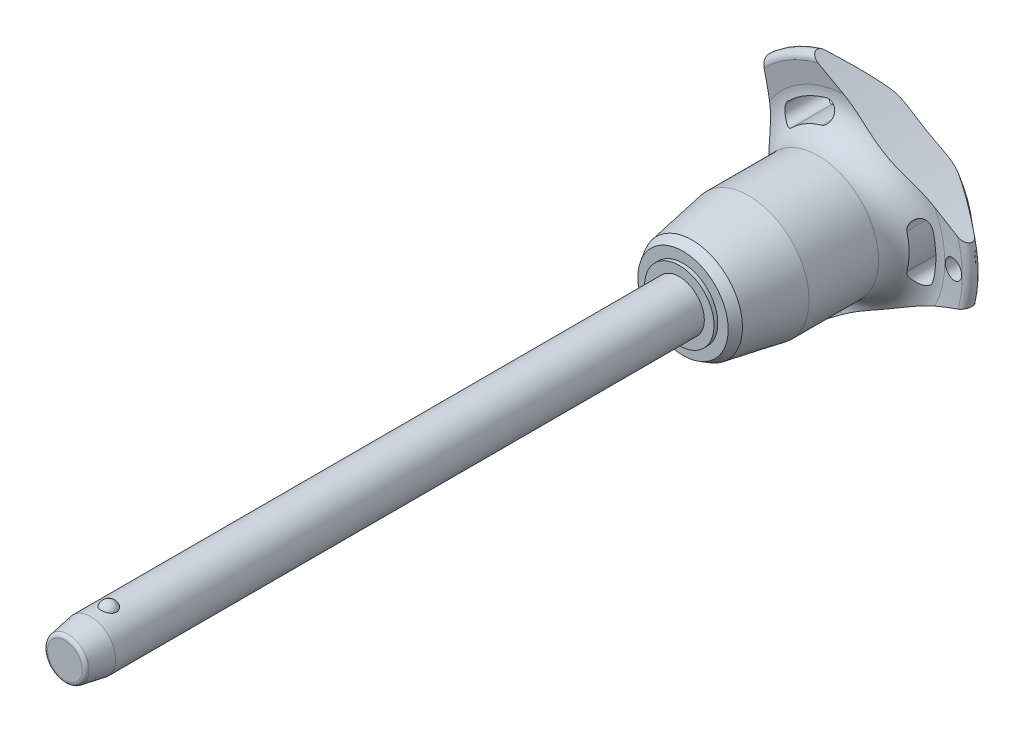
from build123d import *

# Parameters (mm, degrees)
SKETCH1_R           = 4
BOSS_EXTRUDE1_DEPTH = 90
SKETCH2_R           = 3.4
BOSS_EXTRUDE2_DEPTH = 33.3
BOSS_EXTRUDE3_START = 8.2
SKETCH1_2_R         = 4
BOSS_EXTRUDE3_DEPTH = 8.2
CHAMFER1_SIZE       = 4.1
CHAMFER1_SIZE2      = 0.722940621
FILLET1_R           = 0.6
SKETCH6_R           = 102.8
CUT_EXTRUDE1_DEPTH  = 127.380768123
CIRPATTERN1_COUNT   = 3
SKETCH7_R           = 1.5
CUT_EXTRUDE2_DEPTH  = 127.252726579


with BuildPart() as part:
    # Sketch1 → Boss-Extrude1 (new body)
    with BuildSketch(Plane.XY):
        Circle(SKETCH1_R)
    extrude(amount=-BOSS_EXTRUDE1_DEPTH)

    # Sketch2 → Boss-Extrude2 (add)
    with BuildSketch(Plane(origin=(0, 0, -90), x_dir=(-1, 0, 0), z_dir=(0, 0, -1))):
        Circle(SKETCH2_R)
    extrude(amount=BOSS_EXTRUDE2_DEPTH)

    # Sketch3 → Revolve1 (revolve)
    with BuildSketch(Plane(origin=(0, 0, 0), x_dir=(0, 0, -1), z_dir=(1, 0, 0))):
        with BuildLine():
            Line((-1.2, 4.8), (-1.2, 2.2))
            ThreePointArc((-1.2, 2.2), (0.1, 3.5), (-1.2, 4.8))
        make_face()
        with BuildLine():
            Line((-1.2, -2.2), (-1.2, -4.8))
            ThreePointArc((-1.2, -4.8), (0.1, -3.5), (-1.2, -2.2))
        make_face()
    revolve(axis=Axis((0, -2.2, 1.2), (0, 1, 0)))

    # Sketch1_2 → Boss-Extrude3 (add)
    with BuildSketch(Plane.XY.offset(BOSS_EXTRUDE3_START)):
        Circle(SKETCH1_2_R)
    extrude(amount=-BOSS_EXTRUDE3_DEPTH)

    # Chamfer1
    chamfer1_edges = [part.edges().sort_by_distance(p)[0] for p in [
        (-4, 0, 8.2),
    ]]
    chamfer1_side = [part.faces().sort_by_distance(p)[0] for p in [
        (-4, 0, -40.9),
    ]]
    chamfer(chamfer1_edges, length=CHAMFER1_SIZE, length2=CHAMFER1_SIZE2, reference=chamfer1_side[0])

    # Fillet1
    fillet1_edges = [part.edges().sort_by_distance(p)[0] for p in [
        (-3.277059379, 0, 8.2),
        (3.4, 0, -123.3),
    ]]
    fillet(fillet1_edges, radius=FILLET1_R)

    # Sketch4 → Revolve2 (revolve)
    with BuildSketch(Plane(origin=(0, 0, 0), x_dir=(0, 0, -1), z_dir=(1, 0, 0)), mode=Mode.PRIVATE) as revolve2_sk:
        Polygon((90, 0), (90, 5.554101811), (90.6, 5.554101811), (90.6, 7.220004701), (92.042714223, 8.052956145), (101.1, 9.65), (112.2, 9.65), (112.2, 0), align=None)
    revolve(revolve2_sk.sketch.rotate(Axis((0, 0, -112.2), (0, 0, 1)), 90), axis=Axis((0, 0, -112.2), (0, 0, 1)))

    # Sketch5 → Revolve3 (revolve)
    with BuildSketch(Plane(origin=(0, 0, 0), x_dir=(0, 0, -1), z_dir=(1, 0, 0)), mode=Mode.PRIVATE) as revolve3_sk:
        with BuildLine():
            Line((117.16082631, 15.274661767), (116.757834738, 18.475067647))
            ThreePointArc((116.757834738, 18.475067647), (117.349836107, 19.516443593), (118.516044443, 19.24278761))
            Line((118.516044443, 19.24278761), (122.835691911, 14.094832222))
            ThreePointArc((122.835691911, 14.094832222), (123.3, 12.689260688), (122.67067517, 11.349423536))
            ThreePointArc((122.67067517, 11.349423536), (119.033110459, 6.185112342), (117.75, 0))
            Line((117.75, 0), (112.2, 0))
            Line((112.2, 0), (112.2, 9.65))
            ThreePointArc((112.2, 9.65), (115.949887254, 11.342683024), (117.16082631, 15.274661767))
        make_face()
    revolve(revolve3_sk.sketch.rotate(Axis((0, 0, -117.75), (0, 0, 1)), 90), axis=Axis((0, 0, -117.75), (0, 0, 1)))

    # Sketch6 → Cut-Extrude1 (cut, through all)
    with BuildSketch(Plane.XY):
        with Locations((-115.2, 0)):
            Circle(SKETCH6_R)
        with BuildLine():
            ThreePointArc((13.411913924, -3.529271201), (13.868496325, 0), (13.411913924, 3.529271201))
            ThreePointArc((13.411913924, 3.529271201), (11.694200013, 4.531299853), (10.692171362, 2.813585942))
            ThreePointArc((10.692171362, 2.813585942), (11.056165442, 0), (10.692171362, -2.813585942))
            ThreePointArc((10.692171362, -2.813585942), (11.694200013, -4.531299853), (13.411913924, -3.529271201))
        make_face()
    cut_extrude1 = extrude(amount=-CUT_EXTRUDE1_DEPTH, mode=Mode.SUBTRACT)

    # CirPattern1: Cut-Extrude1 ×3 about axis
    cirpattern1_axis = Axis((0, 0, 0), (0, 0, 1))
    for i in range(1, CIRPATTERN1_COUNT):
        add(cut_extrude1.rotate(cirpattern1_axis, i * 360 / CIRPATTERN1_COUNT), mode=Mode.SUBTRACT)

    # Sketch7 → Cut-Extrude2 (cut, through all)
    with BuildSketch(Plane.XY):
        with Locations(Location((16.868496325, 0, 0), (0, 0, 225.467095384))):
            Circle(SKETCH7_R)
    extrude(amount=-CUT_EXTRUDE2_DEPTH, mode=Mode.SUBTRACT)


solid = part.part
